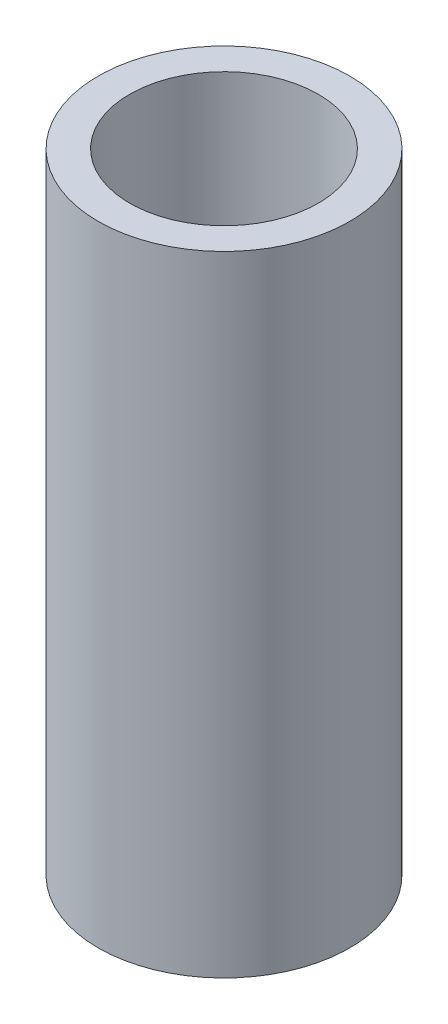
from build123d import *

# Parameters (mm, degrees)
SKETCH2_R               = 25.4
SKETCH2_R_2             = 19.05
BOSS_EXTRUDE1_DEPTH     = 406.4
CUT_EXTRUDE1_DEPTH      = 408.984411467
CUT_EXTRUDE1_DEPTH_BACK = 408.984411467
SKETCH3_W               = 50.8
SKETCH3_H               = 279.4


with BuildPart() as part:
    # Sketch2 → Boss-Extrude1 (new body)
    with BuildSketch(Plane(origin=(0, 0, 0), x_dir=(1, 0, 0), z_dir=(0, 1, 0))):
        with Locations(Location((0, 0, 0), (0, 0, 270))):
            Circle(SKETCH2_R)
        with Locations(Location((0, 0, 0), (0, 0, 270))):
            Circle(SKETCH2_R_2, mode=Mode.SUBTRACT)
    extrude(amount=BOSS_EXTRUDE1_DEPTH)

    # Sketch3 → Cut-Extrude1 (cut, two sides: drawn at the far end of the back side and taken through both)
    with BuildSketch(Plane(origin=(0, 0, 0), x_dir=(0, 0, -1), z_dir=(1, 0, 0)).offset(-CUT_EXTRUDE1_DEPTH_BACK)):
        with Locations((0, 266.7)):
            Rectangle(SKETCH3_W, SKETCH3_H)
    extrude(amount=CUT_EXTRUDE1_DEPTH + CUT_EXTRUDE1_DEPTH_BACK, mode=Mode.SUBTRACT)


solid = part.part
